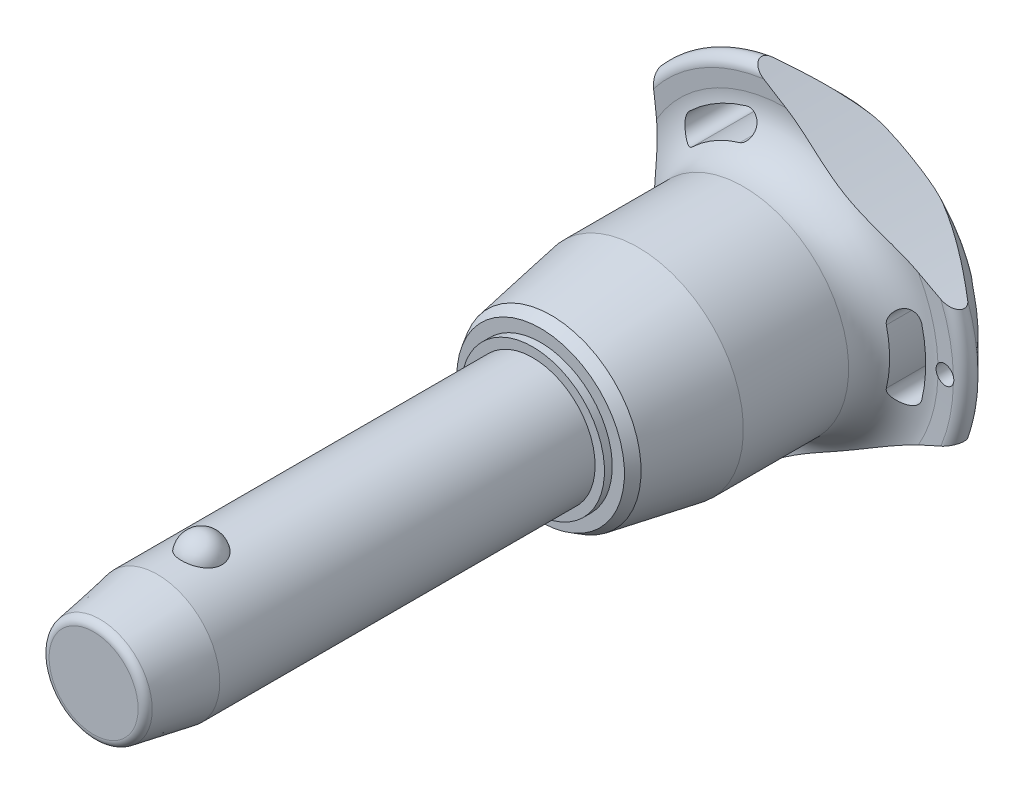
from build123d import *

# Parameters (mm, degrees)
SKETCH1_R           = 10
BOSS_EXTRUDE1_DEPTH = 50
SKETCH2_R           = 8.75
BOSS_EXTRUDE2_DEPTH = 50.7
BOSS_EXTRUDE3_START = 20.5
SKETCH1_2_R         = 10
BOSS_EXTRUDE3_DEPTH = 20.5
CHAMFER1_SIZE       = 10.25
CHAMFER1_SIZE2      = 1.807351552
FILLET1_R           = 1.25
SKETCH6_R           = 176.92625
CUT_EXTRUDE1_DEPTH  = 109.493284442
CIRPATTERN1_COUNT   = 3
SKETCH7_R           = 1.5
CUT_EXTRUDE2_DEPTH  = 109.35288326


with BuildPart() as part:
    # Sketch1 → Boss-Extrude1 (new body)
    with BuildSketch(Plane.XY):
        Circle(SKETCH1_R)
    extrude(amount=-BOSS_EXTRUDE1_DEPTH)

    # Sketch2 → Boss-Extrude2 (add)
    with BuildSketch(Plane(origin=(0, 0, -50), x_dir=(-1, 0, 0), z_dir=(0, 0, -1))):
        with Locations(Location((0, 0, 0), (0, 0, 180))):
            Circle(SKETCH2_R)
    extrude(amount=BOSS_EXTRUDE2_DEPTH)

    # Sketch3 → Revolve1 (revolve)
    with BuildSketch(Plane(origin=(0, 0, 0), x_dir=(0, 0, -1), z_dir=(1, 0, 0))):
        with BuildLine():
            Line((-3.201562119, 12.5), (-3.201562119, 5.9))
            ThreePointArc((-3.201562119, 5.9), (0.098437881, 9.2), (-3.201562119, 12.5))
        make_face()
        with BuildLine():
            Line((-3.201562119, -5.9), (-3.201562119, -12.5))
            ThreePointArc((-3.201562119, -12.5), (0.098437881, -9.2), (-3.201562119, -5.9))
        make_face()
    revolve(axis=Axis((0, -5.9, 3.201562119), (0, 1, 0)))

    # Sketch1_2 → Boss-Extrude3 (add)
    with BuildSketch(Plane.XY.offset(BOSS_EXTRUDE3_START)):
        Circle(SKETCH1_2_R)
    extrude(amount=-BOSS_EXTRUDE3_DEPTH)

    # Chamfer1
    chamfer1_edges = [part.edges().sort_by_distance(p)[0] for p in [
        (-10, 0, 20.5),
    ]]
    chamfer1_side = [part.faces().sort_by_distance(p)[0] for p in [
        (-10, 0, -14.75),
    ]]
    chamfer(chamfer1_edges, length=CHAMFER1_SIZE, length2=CHAMFER1_SIZE2, reference=chamfer1_side[0])

    # Fillet1
    fillet1_edges = [part.edges().sort_by_distance(p)[0] for p in [
        (-8.192648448, 0, 20.5),
        (-8.75, 0, -100.7),
    ]]
    fillet(fillet1_edges, radius=FILLET1_R)

    # Sketch4 → Revolve2 (revolve)
    with BuildSketch(Plane(origin=(0, 0, 0), x_dir=(0, 0, -1), z_dir=(1, 0, 0)), mode=Mode.PRIVATE) as revolve2_sk:
        Polygon((50, 0), (50, 11.504815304), (51.25, 11.504815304), (51.25, 13.461079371), (52.944174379, 14.439211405), (66.9, 16.9), (83.8, 16.9), (83.8, 0), align=None)
    revolve(revolve2_sk.sketch.rotate(Axis((0, 0, -83.8), (0, 0, 1)), 90), axis=Axis((0, 0, -83.8), (0, 0, 1)))

    # Sketch5 → Revolve3 (revolve)
    with BuildSketch(Plane(origin=(0, 0, 0), x_dir=(0, 0, -1), z_dir=(1, 0, 0)), mode=Mode.PRIVATE) as revolve3_sk:
        with BuildLine():
            Line((90.790129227, 24.271609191), (90.652256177, 26.865060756))
            ThreePointArc((90.652256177, 26.865060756), (91.598671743, 28.411427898), (93.38137085, 28.08137085))
            Line((93.38137085, 28.08137085), (99.763226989, 21.69951471))
            ThreePointArc((99.763226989, 21.69951471), (100.7, 19.381044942), (99.683055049, 17.096604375))
            ThreePointArc((99.683055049, 17.096604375), (94.18864484, 9.321268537), (92.25, 0))
            Line((92.25, 0), (83.8, 0))
            Line((83.8, 0), (83.8, 16.9))
            ThreePointArc((83.8, 16.9), (88.879432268, 19.083427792), (90.790129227, 24.271609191))
        make_face()
    revolve(revolve3_sk.sketch.rotate(Axis((0, 0, -92.25), (0, 0, 1)), 90), axis=Axis((0, 0, -92.25), (0, 0, 1)))

    # Sketch6 → Cut-Extrude1 (cut, through all)
    with BuildSketch(Plane.XY):
        with Locations((-197.42625, 0)):
            Circle(SKETCH6_R)
        with BuildLine():
            ThreePointArc((21.802992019, -5.260839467), (22.428706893, 0), (21.802992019, 5.260839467))
            ThreePointArc((21.802992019, 5.260839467), (19.579234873, 6.620060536), (18.220013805, 4.39630339))
            ThreePointArc((18.220013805, 4.39630339), (18.742902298, 0), (18.220013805, -4.39630339))
            ThreePointArc((18.220013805, -4.39630339), (19.579234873, -6.620060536), (21.802992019, -5.260839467))
        make_face()
    cut_extrude1 = extrude(amount=-CUT_EXTRUDE1_DEPTH, mode=Mode.SUBTRACT)

    # CirPattern1: Cut-Extrude1 ×3 about axis
    cirpattern1_axis = Axis((0, 0, 0), (0, 0, 1))
    for i in range(1, CIRPATTERN1_COUNT):
        add(cut_extrude1.rotate(cirpattern1_axis, i * 360 / CIRPATTERN1_COUNT), mode=Mode.SUBTRACT)

    # Sketch7 → Cut-Extrude2 (cut, through all)
    with BuildSketch(Plane.XY):
        with Locations(Location((25.428706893, 0, 0), (0, 0, 17.230769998))):
            Circle(SKETCH7_R)
    extrude(amount=-CUT_EXTRUDE2_DEPTH, mode=Mode.SUBTRACT)


solid = part.part
